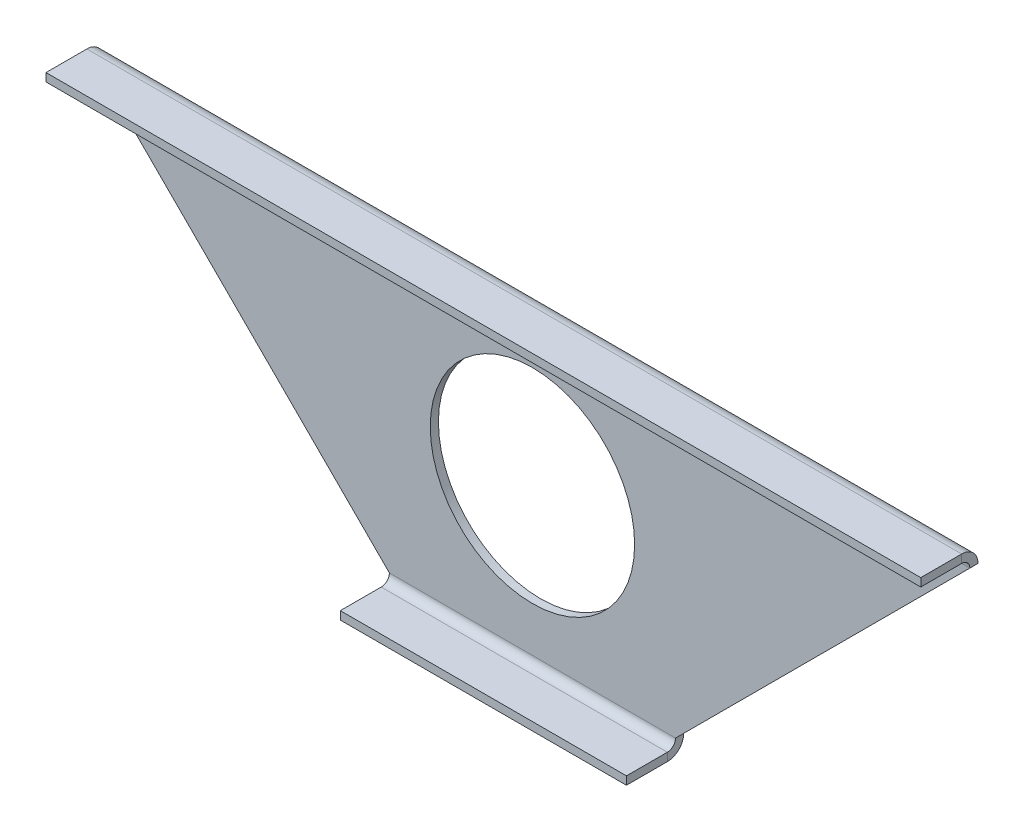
ISO-10303-21;
HEADER;
FILE_DESCRIPTION(('STEP AP214'),'2;1');
FILE_NAME('part.step','',(''),(''),'','','');
FILE_SCHEMA(('AUTOMOTIVE_DESIGN { 1 0 10303 214 1 1 1 1 }'));
ENDSEC;
DATA;
#1=APPLICATION_CONTEXT('core data for automotive mechanical design processes');
#2=APPLICATION_PROTOCOL_DEFINITION('international standard','automotive_design',2000,#1);
#3=PRODUCT_CONTEXT('',#1,'mechanical');
#4=PRODUCT('Part','Part','',(#3));
#5=PRODUCT_RELATED_PRODUCT_CATEGORY('part','',(#4));
#6=PRODUCT_DEFINITION_FORMATION('','',#4);
#7=PRODUCT_DEFINITION_CONTEXT('part definition',#1,'design');
#8=PRODUCT_DEFINITION('design','',#6,#7);
#9=PRODUCT_DEFINITION_SHAPE('','',#8);
#10=(LENGTH_UNIT() NAMED_UNIT(*) SI_UNIT(.MILLI.,.METRE.));
#11=(NAMED_UNIT(*) PLANE_ANGLE_UNIT() SI_UNIT($,.RADIAN.));
#12=(NAMED_UNIT(*) SI_UNIT($,.STERADIAN.) SOLID_ANGLE_UNIT());
#13=UNCERTAINTY_MEASURE_WITH_UNIT(LENGTH_MEASURE(1.E-05),#10,'distance_accuracy_value','');
#14=(GEOMETRIC_REPRESENTATION_CONTEXT(3) GLOBAL_UNCERTAINTY_ASSIGNED_CONTEXT((#13)) GLOBAL_UNIT_ASSIGNED_CONTEXT((#10,
#11,#12)) REPRESENTATION_CONTEXT('',''));
#15=CARTESIAN_POINT('',(0.,0.,0.));
#16=DIRECTION('',(0.,0.,1.));
#17=DIRECTION('',(1.,0.,0.));
#18=AXIS2_PLACEMENT_3D('',#15,#16,#17);
#19=CARTESIAN_POINT('',(-17.4999999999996,3.60822483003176E-13,-0.999999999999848));
#20=DIRECTION('',(-0.707106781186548,-0.707106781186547,0.));
#21=DIRECTION('',(0.707106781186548,-0.707106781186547,0.));
#22=AXIS2_PLACEMENT_3D('',#19,#20,#21);
#23=PLANE('',#22);
#24=DIRECTION('',(0.707106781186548,-0.707106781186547,0.));
#25=VECTOR('',#24,1.);
#26=CARTESIAN_POINT('',(-17.4999999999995,3.33066907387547E-13,1.52655665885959E-13));
#27=LINE('',#26,#25);
#28=CARTESIAN_POINT('',(-53.4999999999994,36.0000000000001,0.));
#29=VERTEX_POINT('',#28);
#30=CARTESIAN_POINT('',(-17.4999999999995,3.33066907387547E-13,1.52655665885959E-13));
#31=VERTEX_POINT('',#30);
#32=EDGE_CURVE('E120',#29,#31,#27,.T.);
#33=ORIENTED_EDGE('',*,*,#32,.F.);
#34=DIRECTION('',(0.,0.,0.999999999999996));
#35=VECTOR('',#34,1.);
#36=CARTESIAN_POINT('',(-53.4999999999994,36.0000000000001,-0.999999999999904));
#37=LINE('',#36,#35);
#38=CARTESIAN_POINT('',(-53.4999999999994,36.0000000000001,-0.999999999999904));
#39=VERTEX_POINT('',#38);
#40=EDGE_CURVE('E88',#39,#29,#37,.T.);
#41=ORIENTED_EDGE('',*,*,#40,.F.);
#42=DIRECTION('',(0.707106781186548,-0.707106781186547,0.));
#43=VECTOR('',#42,1.);
#44=CARTESIAN_POINT('',(-17.4999999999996,3.60822483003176E-13,-0.999999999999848));
#45=LINE('',#44,#43);
#46=CARTESIAN_POINT('',(-17.4999999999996,3.60822483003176E-13,-0.999999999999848));
#47=VERTEX_POINT('',#46);
#48=EDGE_CURVE('E122',#39,#47,#45,.T.);
#49=ORIENTED_EDGE('',*,*,#48,.T.);
#50=DIRECTION('',(0.,0.,0.999999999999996));
#51=VECTOR('',#50,1.);
#52=CARTESIAN_POINT('',(-17.4999999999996,3.60822483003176E-13,-0.999999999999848));
#53=LINE('',#52,#51);
#54=EDGE_CURVE('E13',#47,#31,#53,.T.);
#55=ORIENTED_EDGE('',*,*,#54,.T.);
#56=EDGE_LOOP('',(#33,#41,#49,#55));
#57=FACE_BOUND('',#56,.T.);
#58=ADVANCED_FACE('F78',(#57),#23,.T.);
#59=CARTESIAN_POINT('',(17.5000000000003,7.21644966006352E-13,-0.999999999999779));
#60=DIRECTION('',(0.707106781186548,-0.707106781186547,0.));
#61=DIRECTION('',(0.707106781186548,0.707106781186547,0.));
#62=AXIS2_PLACEMENT_3D('',#59,#60,#61);
#63=PLANE('',#62);
#64=DIRECTION('',(0.707106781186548,0.707106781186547,0.));
#65=VECTOR('',#64,1.);
#66=CARTESIAN_POINT('',(17.5000000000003,7.21644966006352E-13,2.22044604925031E-13));
#67=LINE('',#66,#65);
#68=CARTESIAN_POINT('',(17.5000000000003,7.21644966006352E-13,2.22044604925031E-13));
#69=VERTEX_POINT('',#68);
#70=CARTESIAN_POINT('',(53.5000000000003,36.0000000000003,3.46944695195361E-13));
#71=VERTEX_POINT('',#70);
#72=EDGE_CURVE('E143',#69,#71,#67,.T.);
#73=ORIENTED_EDGE('',*,*,#72,.F.);
#74=DIRECTION('',(0.,0.,0.999999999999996));
#75=VECTOR('',#74,1.);
#76=CARTESIAN_POINT('',(17.5000000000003,7.21644966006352E-13,-0.999999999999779));
#77=LINE('',#76,#75);
#78=CARTESIAN_POINT('',(17.5000000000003,7.21644966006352E-13,-0.999999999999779));
#79=VERTEX_POINT('',#78);
#80=EDGE_CURVE('E213',#79,#69,#77,.T.);
#81=ORIENTED_EDGE('',*,*,#80,.F.);
#82=DIRECTION('',(0.707106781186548,0.707106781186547,0.));
#83=VECTOR('',#82,1.);
#84=CARTESIAN_POINT('',(17.5000000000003,7.21644966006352E-13,-0.999999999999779));
#85=LINE('',#84,#83);
#86=CARTESIAN_POINT('',(53.5000000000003,36.0000000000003,-0.999999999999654));
#87=VERTEX_POINT('',#86);
#88=EDGE_CURVE('E207',#79,#87,#85,.T.);
#89=ORIENTED_EDGE('',*,*,#88,.T.);
#90=DIRECTION('',(0.,0.,0.999999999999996));
#91=VECTOR('',#90,1.);
#92=CARTESIAN_POINT('',(53.5000000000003,36.0000000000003,-0.999999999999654));
#93=LINE('',#92,#91);
#94=EDGE_CURVE('E218',#87,#71,#93,.T.);
#95=ORIENTED_EDGE('',*,*,#94,.T.);
#96=EDGE_LOOP('',(#73,#81,#89,#95));
#97=FACE_BOUND('',#96,.T.);
#98=ADVANCED_FACE('F80',(#97),#63,.T.);
#99=CARTESIAN_POINT('',(0.,0.,-1.));
#100=DIRECTION('',(0.,0.,0.999999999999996));
#101=DIRECTION('',(1.,0.,0.));
#102=AXIS2_PLACEMENT_3D('',#99,#100,#101);
#103=PLANE('',#102);
#104=CARTESIAN_POINT('',(2.77555756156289E-13,18.0000000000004,-1.));
#105=DIRECTION('',(0.,0.,-0.999999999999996));
#106=DIRECTION('',(-1.,0.,0.));
#107=AXIS2_PLACEMENT_3D('',#104,#105,#106);
#108=CIRCLE('',#107,12.5);
#109=CARTESIAN_POINT('',(-12.4999999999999,18.0000000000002,-0.999999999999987));
#110=VERTEX_POINT('',#109);
#111=EDGE_CURVE('E268',#110,#110,#108,.T.);
#112=ORIENTED_EDGE('',*,*,#111,.F.);
#113=EDGE_LOOP('',(#112));
#114=FACE_BOUND('',#113,.T.);
#115=DIRECTION('',(1.,0.,0.));
#116=VECTOR('',#115,1.);
#117=CARTESIAN_POINT('',(-17.4999999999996,3.60822483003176E-13,-0.999999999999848));
#118=LINE('',#117,#116);
#119=EDGE_CURVE('E97',#47,#79,#118,.T.);
#120=ORIENTED_EDGE('',*,*,#119,.F.);
#121=ORIENTED_EDGE('',*,*,#48,.F.);
#122=DIRECTION('',(-1.,0.,0.));
#123=VECTOR('',#122,1.);
#124=CARTESIAN_POINT('',(-53.4999999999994,36.0000000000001,-0.999999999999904));
#125=LINE('',#124,#123);
#126=EDGE_CURVE('E210',#87,#39,#125,.T.);
#127=ORIENTED_EDGE('',*,*,#126,.F.);
#128=ORIENTED_EDGE('',*,*,#88,.F.);
#129=EDGE_LOOP('',(#120,#121,#127,#128));
#130=FACE_BOUND('',#129,.T.);
#131=ADVANCED_FACE('F279',(#114,#130),#103,.F.);
#132=CARTESIAN_POINT('',(0.,0.,0.));
#133=DIRECTION('',(0.,0.,0.999999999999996));
#134=DIRECTION('',(1.,0.,0.));
#135=AXIS2_PLACEMENT_3D('',#132,#133,#134);
#136=PLANE('',#135);
#137=CARTESIAN_POINT('',(2.77555756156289E-13,18.0000000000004,0.));
#138=DIRECTION('',(0.,0.,0.999999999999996));
#139=DIRECTION('',(1.,0.,0.));
#140=AXIS2_PLACEMENT_3D('',#137,#138,#139);
#141=CIRCLE('',#140,12.5);
#142=CARTESIAN_POINT('',(-12.4999999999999,18.0000000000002,0.));
#143=VERTEX_POINT('',#142);
#144=EDGE_CURVE('E82',#143,#143,#141,.T.);
#145=ORIENTED_EDGE('',*,*,#144,.F.);
#146=EDGE_LOOP('',(#145));
#147=FACE_BOUND('',#146,.T.);
#148=DIRECTION('',(1.,0.,0.));
#149=VECTOR('',#148,1.);
#150=CARTESIAN_POINT('',(-17.4999999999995,3.33066907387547E-13,1.52655665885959E-13));
#151=LINE('',#150,#149);
#152=EDGE_CURVE('E130',#31,#69,#151,.T.);
#153=ORIENTED_EDGE('',*,*,#152,.T.);
#154=ORIENTED_EDGE('',*,*,#72,.T.);
#155=DIRECTION('',(-1.,0.,0.));
#156=VECTOR('',#155,1.);
#157=CARTESIAN_POINT('',(-53.4999999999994,36.0000000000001,0.));
#158=LINE('',#157,#156);
#159=EDGE_CURVE('E115',#71,#29,#158,.T.);
#160=ORIENTED_EDGE('',*,*,#159,.T.);
#161=ORIENTED_EDGE('',*,*,#32,.T.);
#162=EDGE_LOOP('',(#153,#154,#160,#161));
#163=FACE_BOUND('',#162,.T.);
#164=ADVANCED_FACE('F129',(#147,#163),#136,.T.);
#165=CARTESIAN_POINT('',(53.5000000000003,36.0000000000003,1.00000000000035));
#166=DIRECTION('',(1.,0.,0.));
#167=DIRECTION('',(0.,0.,-0.999999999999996));
#168=AXIS2_PLACEMENT_3D('',#165,#166,#167);
#169=PLANE('',#168);
#170=DIRECTION('',(0.,-0.999999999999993,0.));
#171=VECTOR('',#170,1.);
#172=CARTESIAN_POINT('',(53.5000000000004,38.0000000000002,1.00000000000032));
#173=LINE('',#172,#171);
#174=CARTESIAN_POINT('',(53.5000000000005,37.0000000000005,1.00000000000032));
#175=VERTEX_POINT('',#174);
#176=CARTESIAN_POINT('',(53.5000000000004,38.0000000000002,1.00000000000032));
#177=VERTEX_POINT('',#176);
#178=EDGE_CURVE('E193',#175,#177,#173,.F.);
#179=ORIENTED_EDGE('',*,*,#178,.F.);
#180=CARTESIAN_POINT('',(53.5000000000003,36.0000000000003,1.00000000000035));
#181=DIRECTION('',(-1.,0.,0.));
#182=DIRECTION('',(0.,0.,0.999999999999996));
#183=AXIS2_PLACEMENT_3D('',#180,#181,#182);
#184=CIRCLE('',#183,0.999999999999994);
#185=EDGE_CURVE('E201',#71,#175,#184,.F.);
#186=ORIENTED_EDGE('',*,*,#185,.F.);
#187=ORIENTED_EDGE('',*,*,#94,.F.);
#188=CARTESIAN_POINT('',(53.5000000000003,36.0000000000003,1.00000000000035));
#189=DIRECTION('',(-1.,0.,0.));
#190=DIRECTION('',(0.,0.,0.999999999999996));
#191=AXIS2_PLACEMENT_3D('',#188,#189,#190);
#192=CIRCLE('',#191,1.99999999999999);
#193=EDGE_CURVE('E144',#87,#177,#192,.F.);
#194=ORIENTED_EDGE('',*,*,#193,.T.);
#195=EDGE_LOOP('',(#179,#186,#187,#194));
#196=FACE_BOUND('',#195,.T.);
#197=ADVANCED_FACE('F278',(#196),#169,.T.);
#198=CARTESIAN_POINT('',(-53.4999999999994,36.0000000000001,1.0000000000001));
#199=DIRECTION('',(1.,0.,0.));
#200=DIRECTION('',(0.,0.,-0.999999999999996));
#201=AXIS2_PLACEMENT_3D('',#198,#199,#200);
#202=PLANE('',#201);
#203=CARTESIAN_POINT('',(-53.4999999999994,36.0000000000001,1.0000000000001));
#204=DIRECTION('',(-1.,0.,0.));
#205=DIRECTION('',(0.,0.,0.999999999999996));
#206=AXIS2_PLACEMENT_3D('',#203,#204,#205);
#207=CIRCLE('',#206,0.999999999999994);
#208=CARTESIAN_POINT('',(-53.4999999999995,36.9999999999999,1.00000000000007));
#209=VERTEX_POINT('',#208);
#210=EDGE_CURVE('E162',#209,#29,#207,.T.);
#211=ORIENTED_EDGE('',*,*,#210,.F.);
#212=DIRECTION('',(0.,-0.999999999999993,0.));
#213=VECTOR('',#212,1.);
#214=CARTESIAN_POINT('',(-53.4999999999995,36.9999999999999,1.00000000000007));
#215=LINE('',#214,#213);
#216=CARTESIAN_POINT('',(-53.4999999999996,38.0000000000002,1.00000000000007));
#217=VERTEX_POINT('',#216);
#218=EDGE_CURVE('E187',#209,#217,#215,.F.);
#219=ORIENTED_EDGE('',*,*,#218,.T.);
#220=CARTESIAN_POINT('',(-53.4999999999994,36.0000000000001,1.0000000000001));
#221=DIRECTION('',(-1.,0.,0.));
#222=DIRECTION('',(0.,0.,0.999999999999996));
#223=AXIS2_PLACEMENT_3D('',#220,#221,#222);
#224=CIRCLE('',#223,1.99999999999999);
#225=EDGE_CURVE('E198',#217,#39,#224,.T.);
#226=ORIENTED_EDGE('',*,*,#225,.T.);
#227=ORIENTED_EDGE('',*,*,#40,.T.);
#228=EDGE_LOOP('',(#211,#219,#226,#227));
#229=FACE_BOUND('',#228,.T.);
#230=ADVANCED_FACE('F285',(#229),#202,.F.);
#231=CARTESIAN_POINT('',(-53.4999999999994,36.0000000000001,1.0000000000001));
#232=DIRECTION('',(-1.,0.,0.));
#233=DIRECTION('',(0.,0.999999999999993,0.));
#234=AXIS2_PLACEMENT_3D('',#231,#232,#233);
#235=CYLINDRICAL_SURFACE('',#234,1.99999999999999);
#236=ORIENTED_EDGE('',*,*,#126,.T.);
#237=ORIENTED_EDGE('',*,*,#225,.F.);
#238=DIRECTION('',(-1.,0.,0.));
#239=VECTOR('',#238,1.);
#240=CARTESIAN_POINT('',(53.5000000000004,38.0000000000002,1.00000000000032));
#241=LINE('',#240,#239);
#242=EDGE_CURVE('E184',#217,#177,#241,.F.);
#243=ORIENTED_EDGE('',*,*,#242,.T.);
#244=ORIENTED_EDGE('',*,*,#193,.F.);
#245=EDGE_LOOP('',(#236,#237,#243,#244));
#246=FACE_BOUND('',#245,.T.);
#247=ADVANCED_FACE('F321',(#246),#235,.T.);
#248=CARTESIAN_POINT('',(-53.4999999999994,36.0000000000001,1.0000000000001));
#249=DIRECTION('',(-1.,0.,0.));
#250=DIRECTION('',(0.,0.999999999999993,0.));
#251=AXIS2_PLACEMENT_3D('',#248,#249,#250);
#252=CYLINDRICAL_SURFACE('',#251,0.999999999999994);
#253=ORIENTED_EDGE('',*,*,#159,.F.);
#254=ORIENTED_EDGE('',*,*,#185,.T.);
#255=DIRECTION('',(-1.,0.,0.));
#256=VECTOR('',#255,1.);
#257=CARTESIAN_POINT('',(53.5000000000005,37.0000000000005,1.00000000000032));
#258=LINE('',#257,#256);
#259=EDGE_CURVE('E190',#175,#209,#258,.T.);
#260=ORIENTED_EDGE('',*,*,#259,.T.);
#261=ORIENTED_EDGE('',*,*,#210,.T.);
#262=EDGE_LOOP('',(#253,#254,#260,#261));
#263=FACE_BOUND('',#262,.T.);
#264=ADVANCED_FACE('F331',(#263),#252,.F.);
#265=CARTESIAN_POINT('',(53.5000000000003,38.0000000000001,3.46944695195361E-13));
#266=DIRECTION('',(-1.,0.,0.));
#267=DIRECTION('',(0.,0.,0.999999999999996));
#268=AXIS2_PLACEMENT_3D('',#265,#266,#267);
#269=PLANE('',#268);
#270=ORIENTED_EDGE('',*,*,#178,.T.);
#271=DIRECTION('',(0.,0.,-0.999999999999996));
#272=VECTOR('',#271,1.);
#273=CARTESIAN_POINT('',(53.5000000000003,38.0000000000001,2.08166817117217E-13));
#274=LINE('',#273,#272);
#275=CARTESIAN_POINT('',(53.5000000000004,38.0000000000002,6.00000000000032));
#276=VERTEX_POINT('',#275);
#277=EDGE_CURVE('E172',#276,#177,#274,.T.);
#278=ORIENTED_EDGE('',*,*,#277,.F.);
#279=DIRECTION('',(0.,-0.999999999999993,0.));
#280=VECTOR('',#279,1.);
#281=CARTESIAN_POINT('',(53.5000000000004,38.0000000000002,6.00000000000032));
#282=LINE('',#281,#280);
#283=CARTESIAN_POINT('',(53.5000000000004,37.0000000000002,6.00000000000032));
#284=VERTEX_POINT('',#283);
#285=EDGE_CURVE('E163',#276,#284,#282,.T.);
#286=ORIENTED_EDGE('',*,*,#285,.T.);
#287=DIRECTION('',(0.,0.,0.999999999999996));
#288=VECTOR('',#287,1.);
#289=CARTESIAN_POINT('',(53.5000000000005,37.0000000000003,3.46944695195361E-13));
#290=LINE('',#289,#288);
#291=EDGE_CURVE('E181',#284,#175,#290,.F.);
#292=ORIENTED_EDGE('',*,*,#291,.T.);
#293=EDGE_LOOP('',(#270,#278,#286,#292));
#294=FACE_BOUND('',#293,.T.);
#295=ADVANCED_FACE('F341',(#294),#269,.F.);
#296=CARTESIAN_POINT('',(-53.4999999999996,38.,6.00000000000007));
#297=DIRECTION('',(1.,0.,0.));
#298=DIRECTION('',(0.,0.,-0.999999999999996));
#299=AXIS2_PLACEMENT_3D('',#296,#297,#298);
#300=PLANE('',#299);
#301=ORIENTED_EDGE('',*,*,#218,.F.);
#302=DIRECTION('',(0.,0.,-0.999999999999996));
#303=VECTOR('',#302,1.);
#304=CARTESIAN_POINT('',(-53.4999999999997,36.9999999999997,6.00000000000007));
#305=LINE('',#304,#303);
#306=CARTESIAN_POINT('',(-53.4999999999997,36.9999999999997,6.00000000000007));
#307=VERTEX_POINT('',#306);
#308=EDGE_CURVE('E178',#209,#307,#305,.F.);
#309=ORIENTED_EDGE('',*,*,#308,.T.);
#310=DIRECTION('',(0.,-0.999999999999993,0.));
#311=VECTOR('',#310,1.);
#312=CARTESIAN_POINT('',(-53.4999999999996,38.,6.00000000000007));
#313=LINE('',#312,#311);
#314=CARTESIAN_POINT('',(-53.4999999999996,38.,6.00000000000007));
#315=VERTEX_POINT('',#314);
#316=EDGE_CURVE('E159',#315,#307,#313,.T.);
#317=ORIENTED_EDGE('',*,*,#316,.F.);
#318=DIRECTION('',(0.,0.,0.999999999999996));
#319=VECTOR('',#318,1.);
#320=CARTESIAN_POINT('',(-53.4999999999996,38.0000000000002,0.));
#321=LINE('',#320,#319);
#322=EDGE_CURVE('E169',#217,#315,#321,.T.);
#323=ORIENTED_EDGE('',*,*,#322,.F.);
#324=EDGE_LOOP('',(#301,#309,#317,#323));
#325=FACE_BOUND('',#324,.T.);
#326=ADVANCED_FACE('F351',(#325),#300,.F.);
#327=CARTESIAN_POINT('',(4.9960036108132E-13,38.0000000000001,0.));
#328=DIRECTION('',(0.,-0.999999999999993,0.));
#329=DIRECTION('',(0.,0.,-0.999999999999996));
#330=AXIS2_PLACEMENT_3D('',#327,#328,#329);
#331=PLANE('',#330);
#332=ORIENTED_EDGE('',*,*,#242,.F.);
#333=ORIENTED_EDGE('',*,*,#322,.T.);
#334=DIRECTION('',(1.,0.,0.));
#335=VECTOR('',#334,1.);
#336=CARTESIAN_POINT('',(0.,37.9999999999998,6.00000000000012));
#337=LINE('',#336,#335);
#338=EDGE_CURVE('E166',#315,#276,#337,.T.);
#339=ORIENTED_EDGE('',*,*,#338,.T.);
#340=ORIENTED_EDGE('',*,*,#277,.T.);
#341=EDGE_LOOP('',(#332,#333,#339,#340));
#342=FACE_BOUND('',#341,.T.);
#343=ADVANCED_FACE('F361',(#342),#331,.F.);
#344=CARTESIAN_POINT('',(2.08166817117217E-13,37.,0.));
#345=DIRECTION('',(0.,-0.999999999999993,0.));
#346=DIRECTION('',(0.,0.,-0.999999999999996));
#347=AXIS2_PLACEMENT_3D('',#344,#345,#346);
#348=PLANE('',#347);
#349=ORIENTED_EDGE('',*,*,#308,.F.);
#350=ORIENTED_EDGE('',*,*,#259,.F.);
#351=ORIENTED_EDGE('',*,*,#291,.F.);
#352=DIRECTION('',(-1.,0.,0.));
#353=VECTOR('',#352,1.);
#354=CARTESIAN_POINT('',(53.5000000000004,37.0000000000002,6.00000000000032));
#355=LINE('',#354,#353);
#356=EDGE_CURVE('E175',#307,#284,#355,.F.);
#357=ORIENTED_EDGE('',*,*,#356,.F.);
#358=EDGE_LOOP('',(#349,#350,#351,#357));
#359=FACE_BOUND('',#358,.T.);
#360=ADVANCED_FACE('F371',(#359),#348,.T.);
#361=CARTESIAN_POINT('',(53.5000000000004,38.0000000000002,6.00000000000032));
#362=DIRECTION('',(0.,0.,-0.999999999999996));
#363=DIRECTION('',(0.,0.999999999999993,0.));
#364=AXIS2_PLACEMENT_3D('',#361,#362,#363);
#365=PLANE('',#364);
#366=ORIENTED_EDGE('',*,*,#356,.T.);
#367=ORIENTED_EDGE('',*,*,#285,.F.);
#368=ORIENTED_EDGE('',*,*,#338,.F.);
#369=ORIENTED_EDGE('',*,*,#316,.T.);
#370=EDGE_LOOP('',(#366,#367,#368,#369));
#371=FACE_BOUND('',#370,.T.);
#372=ADVANCED_FACE('F381',(#371),#365,.F.);
#373=CARTESIAN_POINT('',(-17.4999999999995,3.33066907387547E-13,1.00000000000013));
#374=DIRECTION('',(-1.,0.,0.));
#375=DIRECTION('',(0.,0.,0.999999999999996));
#376=AXIS2_PLACEMENT_3D('',#373,#374,#375);
#377=PLANE('',#376);
#378=DIRECTION('',(0.,0.999999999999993,0.));
#379=VECTOR('',#378,1.);
#380=CARTESIAN_POINT('',(-17.4999999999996,-1.99999999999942,1.00000000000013));
#381=LINE('',#380,#379);
#382=CARTESIAN_POINT('',(-17.4999999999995,-0.99999999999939,1.00000000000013));
#383=VERTEX_POINT('',#382);
#384=CARTESIAN_POINT('',(-17.4999999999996,-1.99999999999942,1.00000000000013));
#385=VERTEX_POINT('',#384);
#386=EDGE_CURVE('E149',#383,#385,#381,.F.);
#387=ORIENTED_EDGE('',*,*,#386,.F.);
#388=CARTESIAN_POINT('',(-17.4999999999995,3.33066907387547E-13,1.00000000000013));
#389=DIRECTION('',(1.,0.,0.));
#390=DIRECTION('',(0.,0.,-0.999999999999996));
#391=AXIS2_PLACEMENT_3D('',#388,#389,#390);
#392=CIRCLE('',#391,1.);
#393=EDGE_CURVE('E139',#31,#383,#392,.F.);
#394=ORIENTED_EDGE('',*,*,#393,.F.);
#395=ORIENTED_EDGE('',*,*,#54,.F.);
#396=CARTESIAN_POINT('',(-17.4999999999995,3.33066907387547E-13,1.00000000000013));
#397=DIRECTION('',(1.,0.,0.));
#398=DIRECTION('',(0.,0.,-0.999999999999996));
#399=AXIS2_PLACEMENT_3D('',#396,#397,#398);
#400=CIRCLE('',#399,2.);
#401=EDGE_CURVE('E153',#47,#385,#400,.F.);
#402=ORIENTED_EDGE('',*,*,#401,.T.);
#403=EDGE_LOOP('',(#387,#394,#395,#402));
#404=FACE_BOUND('',#403,.T.);
#405=ADVANCED_FACE('F147',(#404),#377,.T.);
#406=CARTESIAN_POINT('',(17.5000000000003,7.21644966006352E-13,1.00000000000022));
#407=DIRECTION('',(-1.,0.,0.));
#408=DIRECTION('',(0.,0.,0.999999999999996));
#409=AXIS2_PLACEMENT_3D('',#406,#407,#408);
#410=PLANE('',#409);
#411=CARTESIAN_POINT('',(17.5000000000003,7.21644966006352E-13,1.00000000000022));
#412=DIRECTION('',(1.,0.,0.));
#413=DIRECTION('',(0.,0.,-0.999999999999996));
#414=AXIS2_PLACEMENT_3D('',#411,#412,#413);
#415=CIRCLE('',#414,1.);
#416=CARTESIAN_POINT('',(17.5000000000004,-0.999999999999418,1.00000000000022));
#417=VERTEX_POINT('',#416);
#418=EDGE_CURVE('E142',#417,#69,#415,.T.);
#419=ORIENTED_EDGE('',*,*,#418,.F.);
#420=DIRECTION('',(0.,0.999999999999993,0.));
#421=VECTOR('',#420,1.);
#422=CARTESIAN_POINT('',(17.5000000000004,-0.999999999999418,1.00000000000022));
#423=LINE('',#422,#421);
#424=CARTESIAN_POINT('',(17.5000000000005,-1.99999999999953,1.00000000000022));
#425=VERTEX_POINT('',#424);
#426=EDGE_CURVE('E242',#417,#425,#423,.F.);
#427=ORIENTED_EDGE('',*,*,#426,.T.);
#428=CARTESIAN_POINT('',(17.5000000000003,7.21644966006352E-13,1.00000000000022));
#429=DIRECTION('',(1.,0.,0.));
#430=DIRECTION('',(0.,0.,-0.999999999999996));
#431=AXIS2_PLACEMENT_3D('',#428,#429,#430);
#432=CIRCLE('',#431,2.);
#433=EDGE_CURVE('E150',#425,#79,#432,.T.);
#434=ORIENTED_EDGE('',*,*,#433,.T.);
#435=ORIENTED_EDGE('',*,*,#80,.T.);
#436=EDGE_LOOP('',(#419,#427,#434,#435));
#437=FACE_BOUND('',#436,.T.);
#438=ADVANCED_FACE('F221',(#437),#410,.F.);
#439=CARTESIAN_POINT('',(17.5000000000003,7.21644966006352E-13,1.00000000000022));
#440=DIRECTION('',(1.,0.,0.));
#441=DIRECTION('',(0.,-0.999999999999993,0.));
#442=AXIS2_PLACEMENT_3D('',#439,#440,#441);
#443=CYLINDRICAL_SURFACE('',#442,2.);
#444=ORIENTED_EDGE('',*,*,#119,.T.);
#445=ORIENTED_EDGE('',*,*,#433,.F.);
#446=DIRECTION('',(1.,0.,0.));
#447=VECTOR('',#446,1.);
#448=CARTESIAN_POINT('',(-17.4999999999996,-1.99999999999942,1.00000000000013));
#449=LINE('',#448,#447);
#450=EDGE_CURVE('E237',#425,#385,#449,.F.);
#451=ORIENTED_EDGE('',*,*,#450,.T.);
#452=ORIENTED_EDGE('',*,*,#401,.F.);
#453=EDGE_LOOP('',(#444,#445,#451,#452));
#454=FACE_BOUND('',#453,.T.);
#455=ADVANCED_FACE('F233',(#454),#443,.T.);
#456=CARTESIAN_POINT('',(17.5000000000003,7.21644966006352E-13,1.00000000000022));
#457=DIRECTION('',(1.,0.,0.));
#458=DIRECTION('',(0.,-0.999999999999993,0.));
#459=AXIS2_PLACEMENT_3D('',#456,#457,#458);
#460=CYLINDRICAL_SURFACE('',#459,1.);
#461=ORIENTED_EDGE('',*,*,#152,.F.);
#462=ORIENTED_EDGE('',*,*,#393,.T.);
#463=DIRECTION('',(1.,0.,0.));
#464=VECTOR('',#463,1.);
#465=CARTESIAN_POINT('',(-17.4999999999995,-0.99999999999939,1.00000000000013));
#466=LINE('',#465,#464);
#467=EDGE_CURVE('E240',#383,#417,#466,.T.);
#468=ORIENTED_EDGE('',*,*,#467,.T.);
#469=ORIENTED_EDGE('',*,*,#418,.T.);
#470=EDGE_LOOP('',(#461,#462,#468,#469));
#471=FACE_BOUND('',#470,.T.);
#472=ADVANCED_FACE('F136',(#471),#460,.F.);
#473=CARTESIAN_POINT('',(-17.4999999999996,-1.99999999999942,1.2490009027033E-13));
#474=DIRECTION('',(1.,0.,0.));
#475=DIRECTION('',(0.,0.,-0.999999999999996));
#476=AXIS2_PLACEMENT_3D('',#473,#474,#475);
#477=PLANE('',#476);
#478=ORIENTED_EDGE('',*,*,#386,.T.);
#479=DIRECTION('',(0.,0.,-0.999999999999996));
#480=VECTOR('',#479,1.);
#481=CARTESIAN_POINT('',(-17.4999999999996,-1.99999999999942,1.2490009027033E-13));
#482=LINE('',#481,#480);
#483=CARTESIAN_POINT('',(-17.4999999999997,-1.99999999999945,6.00000000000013));
#484=VERTEX_POINT('',#483);
#485=EDGE_CURVE('E254',#484,#385,#482,.T.);
#486=ORIENTED_EDGE('',*,*,#485,.F.);
#487=DIRECTION('',(0.,0.999999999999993,0.));
#488=VECTOR('',#487,1.);
#489=CARTESIAN_POINT('',(-17.4999999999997,-1.99999999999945,6.00000000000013));
#490=LINE('',#489,#488);
#491=CARTESIAN_POINT('',(-17.4999999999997,-0.999999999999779,6.00000000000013));
#492=VERTEX_POINT('',#491);
#493=EDGE_CURVE('E263',#484,#492,#490,.T.);
#494=ORIENTED_EDGE('',*,*,#493,.T.);
#495=DIRECTION('',(0.,0.,0.999999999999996));
#496=VECTOR('',#495,1.);
#497=CARTESIAN_POINT('',(-17.4999999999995,-0.99999999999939,1.2490009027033E-13));
#498=LINE('',#497,#496);
#499=EDGE_CURVE('E245',#492,#383,#498,.F.);
#500=ORIENTED_EDGE('',*,*,#499,.T.);
#501=EDGE_LOOP('',(#478,#486,#494,#500));
#502=FACE_BOUND('',#501,.T.);
#503=ADVANCED_FACE('F424',(#502),#477,.F.);
#504=CARTESIAN_POINT('',(17.5000000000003,-1.9999999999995,6.00000000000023));
#505=DIRECTION('',(-1.,0.,0.));
#506=DIRECTION('',(0.,0.,0.999999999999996));
#507=AXIS2_PLACEMENT_3D('',#504,#505,#506);
#508=PLANE('',#507);
#509=ORIENTED_EDGE('',*,*,#426,.F.);
#510=DIRECTION('',(0.,0.,-0.999999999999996));
#511=VECTOR('',#510,1.);
#512=CARTESIAN_POINT('',(17.5000000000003,-0.999999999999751,6.00000000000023));
#513=LINE('',#512,#511);
#514=CARTESIAN_POINT('',(17.5000000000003,-0.999999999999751,6.00000000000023));
#515=VERTEX_POINT('',#514);
#516=EDGE_CURVE('E248',#417,#515,#513,.F.);
#517=ORIENTED_EDGE('',*,*,#516,.T.);
#518=DIRECTION('',(0.,0.999999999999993,0.));
#519=VECTOR('',#518,1.);
#520=CARTESIAN_POINT('',(17.5000000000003,-1.9999999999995,6.00000000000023));
#521=LINE('',#520,#519);
#522=CARTESIAN_POINT('',(17.5000000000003,-1.9999999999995,6.00000000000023));
#523=VERTEX_POINT('',#522);
#524=EDGE_CURVE('E155',#523,#515,#521,.T.);
#525=ORIENTED_EDGE('',*,*,#524,.F.);
#526=DIRECTION('',(0.,0.,0.999999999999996));
#527=VECTOR('',#526,1.);
#528=CARTESIAN_POINT('',(17.5000000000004,-1.99999999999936,2.22044604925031E-13));
#529=LINE('',#528,#527);
#530=EDGE_CURVE('E257',#425,#523,#529,.T.);
#531=ORIENTED_EDGE('',*,*,#530,.F.);
#532=EDGE_LOOP('',(#509,#517,#525,#531));
#533=FACE_BOUND('',#532,.T.);
#534=ADVANCED_FACE('F433',(#533),#508,.F.);
#535=CARTESIAN_POINT('',(2.22044604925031E-13,-1.99999999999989,0.));
#536=DIRECTION('',(0.,0.999999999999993,0.));
#537=DIRECTION('',(0.,0.,0.999999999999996));
#538=AXIS2_PLACEMENT_3D('',#535,#536,#537);
#539=PLANE('',#538);
#540=ORIENTED_EDGE('',*,*,#450,.F.);
#541=ORIENTED_EDGE('',*,*,#530,.T.);
#542=DIRECTION('',(-1.,0.,0.));
#543=VECTOR('',#542,1.);
#544=CARTESIAN_POINT('',(3.19189119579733E-13,-1.99999999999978,5.99999999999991));
#545=LINE('',#544,#543);
#546=EDGE_CURVE('E260',#523,#484,#545,.T.);
#547=ORIENTED_EDGE('',*,*,#546,.T.);
#548=ORIENTED_EDGE('',*,*,#485,.T.);
#549=EDGE_LOOP('',(#540,#541,#547,#548));
#550=FACE_BOUND('',#549,.T.);
#551=ADVANCED_FACE('F443',(#550),#539,.F.);
#552=CARTESIAN_POINT('',(1.66533453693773E-13,-0.999999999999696,0.));
#553=DIRECTION('',(0.,0.999999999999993,0.));
#554=DIRECTION('',(0.,0.,0.999999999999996));
#555=AXIS2_PLACEMENT_3D('',#552,#553,#554);
#556=PLANE('',#555);
#557=ORIENTED_EDGE('',*,*,#516,.F.);
#558=ORIENTED_EDGE('',*,*,#467,.F.);
#559=ORIENTED_EDGE('',*,*,#499,.F.);
#560=DIRECTION('',(1.,0.,0.));
#561=VECTOR('',#560,1.);
#562=CARTESIAN_POINT('',(-17.4999999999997,-0.999999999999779,6.00000000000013));
#563=LINE('',#562,#561);
#564=EDGE_CURVE('E251',#515,#492,#563,.F.);
#565=ORIENTED_EDGE('',*,*,#564,.F.);
#566=EDGE_LOOP('',(#557,#558,#559,#565));
#567=FACE_BOUND('',#566,.T.);
#568=ADVANCED_FACE('F453',(#567),#556,.T.);
#569=CARTESIAN_POINT('',(-17.4999999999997,-1.99999999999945,6.00000000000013));
#570=DIRECTION('',(0.,0.,-0.999999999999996));
#571=DIRECTION('',(0.,0.999999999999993,0.));
#572=AXIS2_PLACEMENT_3D('',#569,#570,#571);
#573=PLANE('',#572);
#574=ORIENTED_EDGE('',*,*,#564,.T.);
#575=ORIENTED_EDGE('',*,*,#493,.F.);
#576=ORIENTED_EDGE('',*,*,#546,.F.);
#577=ORIENTED_EDGE('',*,*,#524,.T.);
#578=EDGE_LOOP('',(#574,#575,#576,#577));
#579=FACE_BOUND('',#578,.T.);
#580=ADVANCED_FACE('F463',(#579),#573,.F.);
#581=CARTESIAN_POINT('',(1.52655665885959E-13,18.0000000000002,6.00000000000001));
#582=DIRECTION('',(0.,0.,-0.999999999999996));
#583=DIRECTION('',(-1.,0.,0.));
#584=AXIS2_PLACEMENT_3D('',#581,#582,#583);
#585=CYLINDRICAL_SURFACE('',#584,12.5);
#586=CARTESIAN_POINT('',(-12.4999999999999,18.0000000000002,0.));
#587=CARTESIAN_POINT('',(-12.4999999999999,18.0000000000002,-0.0104166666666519));
#588=CARTESIAN_POINT('',(-12.4999999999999,18.0000000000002,-0.0208333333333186));
#589=CARTESIAN_POINT('',(-12.4999999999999,18.0000000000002,-0.041666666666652));
#590=CARTESIAN_POINT('',(-12.4999999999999,18.0000000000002,-0.0520833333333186));
#591=CARTESIAN_POINT('',(-12.4999999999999,18.0000000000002,-0.0729166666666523));
#592=CARTESIAN_POINT('',(-12.4999999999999,18.0000000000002,-0.0833333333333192));
#593=CARTESIAN_POINT('',(-12.4999999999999,18.0000000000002,-0.104166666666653));
#594=CARTESIAN_POINT('',(-12.4999999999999,18.0000000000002,-0.11458333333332));
#595=CARTESIAN_POINT('',(-12.4999999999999,18.0000000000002,-0.135416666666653));
#596=CARTESIAN_POINT('',(-12.4999999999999,18.0000000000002,-0.145833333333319));
#597=CARTESIAN_POINT('',(-12.4999999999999,18.0000000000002,-0.166666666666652));
#598=CARTESIAN_POINT('',(-12.4999999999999,18.0000000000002,-0.177083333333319));
#599=CARTESIAN_POINT('',(-12.4999999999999,18.0000000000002,-0.197916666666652));
#600=CARTESIAN_POINT('',(-12.4999999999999,18.0000000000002,-0.208333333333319));
#601=CARTESIAN_POINT('',(-12.4999999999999,18.0000000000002,-0.229166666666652));
#602=CARTESIAN_POINT('',(-12.4999999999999,18.0000000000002,-0.239583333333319));
#603=CARTESIAN_POINT('',(-12.4999999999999,18.0000000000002,-0.260416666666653));
#604=CARTESIAN_POINT('',(-12.4999999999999,18.0000000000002,-0.27083333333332));
#605=CARTESIAN_POINT('',(-12.4999999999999,18.0000000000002,-0.291666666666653));
#606=CARTESIAN_POINT('',(-12.4999999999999,18.0000000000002,-0.30208333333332));
#607=CARTESIAN_POINT('',(-12.4999999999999,18.0000000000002,-0.322916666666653));
#608=CARTESIAN_POINT('',(-12.4999999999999,18.0000000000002,-0.33333333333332));
#609=CARTESIAN_POINT('',(-12.4999999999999,18.0000000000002,-0.354166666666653));
#610=CARTESIAN_POINT('',(-12.4999999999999,18.0000000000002,-0.364583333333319));
#611=CARTESIAN_POINT('',(-12.4999999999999,18.0000000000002,-0.385416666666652));
#612=CARTESIAN_POINT('',(-12.4999999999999,18.0000000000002,-0.395833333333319));
#613=CARTESIAN_POINT('',(-12.4999999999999,18.0000000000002,-0.416666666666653));
#614=CARTESIAN_POINT('',(-12.4999999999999,18.0000000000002,-0.42708333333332));
#615=CARTESIAN_POINT('',(-12.4999999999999,18.0000000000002,-0.447916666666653));
#616=CARTESIAN_POINT('',(-12.4999999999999,18.0000000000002,-0.45833333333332));
#617=CARTESIAN_POINT('',(-12.4999999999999,18.0000000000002,-0.479166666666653));
#618=CARTESIAN_POINT('',(-12.4999999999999,18.0000000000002,-0.48958333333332));
#619=CARTESIAN_POINT('',(-12.4999999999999,18.0000000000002,-0.510416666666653));
#620=CARTESIAN_POINT('',(-12.4999999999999,18.0000000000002,-0.52083333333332));
#621=CARTESIAN_POINT('',(-12.4999999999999,18.0000000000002,-0.541666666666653));
#622=CARTESIAN_POINT('',(-12.4999999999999,18.0000000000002,-0.552083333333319));
#623=CARTESIAN_POINT('',(-12.4999999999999,18.0000000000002,-0.572916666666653));
#624=CARTESIAN_POINT('',(-12.4999999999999,18.0000000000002,-0.58333333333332));
#625=CARTESIAN_POINT('',(-12.4999999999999,18.0000000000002,-0.604166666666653));
#626=CARTESIAN_POINT('',(-12.4999999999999,18.0000000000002,-0.61458333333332));
#627=CARTESIAN_POINT('',(-12.4999999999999,18.0000000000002,-0.635416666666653));
#628=CARTESIAN_POINT('',(-12.4999999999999,18.0000000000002,-0.64583333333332));
#629=CARTESIAN_POINT('',(-12.4999999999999,18.0000000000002,-0.666666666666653));
#630=CARTESIAN_POINT('',(-12.4999999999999,18.0000000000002,-0.67708333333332));
#631=CARTESIAN_POINT('',(-12.4999999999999,18.0000000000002,-0.697916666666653));
#632=CARTESIAN_POINT('',(-12.4999999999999,18.0000000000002,-0.70833333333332));
#633=CARTESIAN_POINT('',(-12.4999999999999,18.0000000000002,-0.729166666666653));
#634=CARTESIAN_POINT('',(-12.4999999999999,18.0000000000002,-0.739583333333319));
#635=CARTESIAN_POINT('',(-12.4999999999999,18.0000000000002,-0.760416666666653));
#636=CARTESIAN_POINT('',(-12.4999999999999,18.0000000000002,-0.77083333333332));
#637=CARTESIAN_POINT('',(-12.4999999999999,18.0000000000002,-0.791666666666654));
#638=CARTESIAN_POINT('',(-12.4999999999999,18.0000000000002,-0.80208333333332));
#639=CARTESIAN_POINT('',(-12.4999999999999,18.0000000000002,-0.822916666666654));
#640=CARTESIAN_POINT('',(-12.4999999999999,18.0000000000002,-0.83333333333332));
#641=CARTESIAN_POINT('',(-12.4999999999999,18.0000000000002,-0.854166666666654));
#642=CARTESIAN_POINT('',(-12.4999999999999,18.0000000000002,-0.86458333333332));
#643=CARTESIAN_POINT('',(-12.4999999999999,18.0000000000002,-0.885416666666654));
#644=CARTESIAN_POINT('',(-12.4999999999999,18.0000000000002,-0.895833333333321));
#645=CARTESIAN_POINT('',(-12.4999999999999,18.0000000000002,-0.916666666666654));
#646=CARTESIAN_POINT('',(-12.4999999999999,18.0000000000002,-0.927083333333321));
#647=CARTESIAN_POINT('',(-12.4999999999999,18.0000000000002,-0.947916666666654));
#648=CARTESIAN_POINT('',(-12.4999999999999,18.0000000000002,-0.95833333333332));
#649=CARTESIAN_POINT('',(-12.4999999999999,18.0000000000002,-0.979166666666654));
#650=CARTESIAN_POINT('',(-12.4999999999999,18.0000000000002,-0.98958333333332));
#651=CARTESIAN_POINT('',(-12.4999999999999,18.0000000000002,-0.999999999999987));
#652=B_SPLINE_CURVE_WITH_KNOTS('',3,(#586,#587,#588,#589,#590,#591,#592,#593,#594,#595,#596,
#597,#598,#599,#600,#601,#602,#603,#604,#605,#606,#607,#608,#609,#610,#611,#612,#613,#614,#615,
#616,#617,#618,#619,#620,#621,#622,#623,#624,#625,#626,#627,#628,#629,#630,#631,#632,#633,#634,
#635,#636,#637,#638,#639,#640,#641,#642,#643,#644,#645,#646,#647,#648,#649,#650,#651),
.UNSPECIFIED.,.F.,.F.,(4,2,2,2,2,2,2,2,2,2,2,2,2,2,2,2,2,2,2,2,2,2,2,2,2,2,2,2,2,2,2,2,4),(0.,
0.03125,0.0625000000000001,0.0937500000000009,0.125000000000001,0.15625,0.1875,0.21875,
0.250000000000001,0.281250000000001,0.312500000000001,0.343750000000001,0.375,0.40625,
0.437500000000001,0.468750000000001,0.500000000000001,0.531250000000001,0.5625,
0.593750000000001,0.625000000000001,0.656250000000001,0.687500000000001,0.718750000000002,
0.750000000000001,0.781250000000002,0.812500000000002,0.843750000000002,0.875000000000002,
0.906250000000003,0.937500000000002,0.968750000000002,1.),.UNSPECIFIED.);
#653=EDGE_CURVE('BSEAM275',#143,#110,#652,.T.);
#654=ORIENTED_EDGE('',*,*,#144,.T.);
#655=ORIENTED_EDGE('',*,*,#111,.T.);
#656=ORIENTED_EDGE('',*,*,#653,.T.);
#657=ORIENTED_EDGE('',*,*,#653,.F.);
#658=EDGE_LOOP('',(#654,#656,#655,#657));
#659=FACE_BOUND('',#658,.T.);
#660=ADVANCED_FACE('F275',(#659),#585,.F.);
#661=CLOSED_SHELL('',(#58,#98,#131,#164,#197,#230,#247,#264,#295,#326,#343,#360,#372,#405,#438,
#455,#472,#503,#534,#551,#568,#580,#660));
#662=MANIFOLD_SOLID_BREP('B2',#661);
#663=ADVANCED_BREP_SHAPE_REPRESENTATION('',(#18,#662),#14);
#664=SHAPE_DEFINITION_REPRESENTATION(#9,#663);
ENDSEC;
END-ISO-10303-21;
